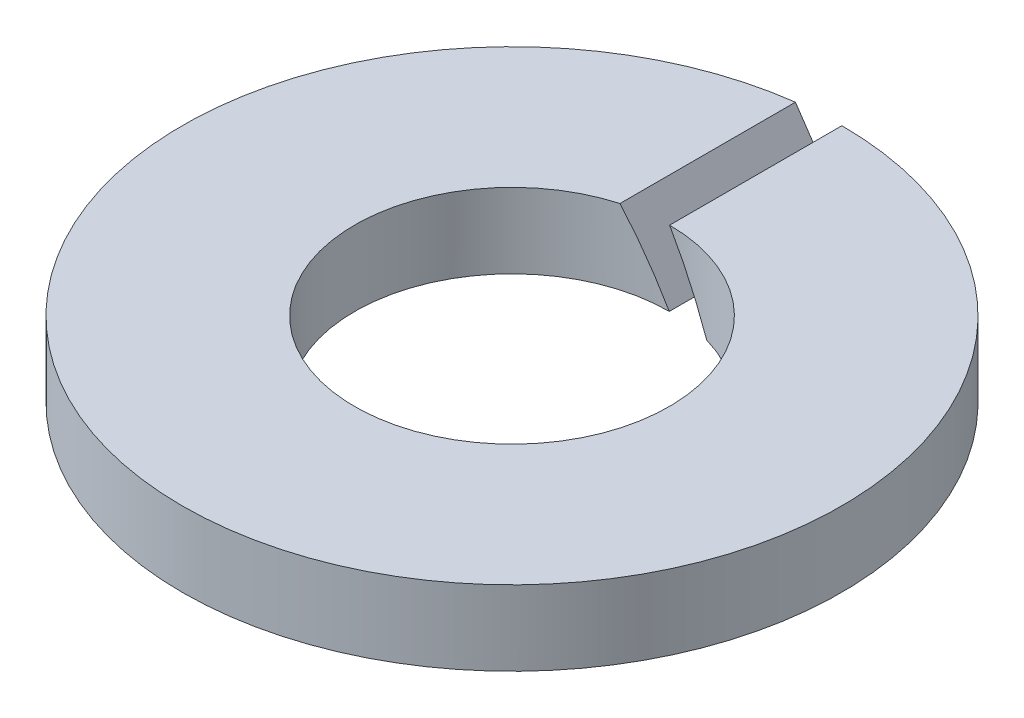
ISO-10303-21;
HEADER;
FILE_DESCRIPTION(('STEP AP214'),'2;1');
FILE_NAME('part.step','',(''),(''),'','','');
FILE_SCHEMA(('AUTOMOTIVE_DESIGN { 1 0 10303 214 1 1 1 1 }'));
ENDSEC;
DATA;
#1=APPLICATION_CONTEXT('core data for automotive mechanical design processes');
#2=APPLICATION_PROTOCOL_DEFINITION('international standard','automotive_design',2000,#1);
#3=PRODUCT_CONTEXT('',#1,'mechanical');
#4=PRODUCT('Part','Part','',(#3));
#5=PRODUCT_RELATED_PRODUCT_CATEGORY('part','',(#4));
#6=PRODUCT_DEFINITION_FORMATION('','',#4);
#7=PRODUCT_DEFINITION_CONTEXT('part definition',#1,'design');
#8=PRODUCT_DEFINITION('design','',#6,#7);
#9=PRODUCT_DEFINITION_SHAPE('','',#8);
#10=(LENGTH_UNIT() NAMED_UNIT(*) SI_UNIT(.MILLI.,.METRE.));
#11=(NAMED_UNIT(*) PLANE_ANGLE_UNIT() SI_UNIT($,.RADIAN.));
#12=(NAMED_UNIT(*) SI_UNIT($,.STERADIAN.) SOLID_ANGLE_UNIT());
#13=UNCERTAINTY_MEASURE_WITH_UNIT(LENGTH_MEASURE(1.E-05),#10,'distance_accuracy_value','');
#14=(GEOMETRIC_REPRESENTATION_CONTEXT(3) GLOBAL_UNCERTAINTY_ASSIGNED_CONTEXT((#13)) GLOBAL_UNIT_ASSIGNED_CONTEXT((#10,
#11,#12)) REPRESENTATION_CONTEXT('',''));
#15=CARTESIAN_POINT('',(0.,0.,0.));
#16=DIRECTION('',(0.,0.,1.));
#17=DIRECTION('',(1.,0.,0.));
#18=AXIS2_PLACEMENT_3D('',#15,#16,#17);
#19=CARTESIAN_POINT('',(0.,0.5,0.));
#20=DIRECTION('',(0.,1.,0.));
#21=DIRECTION('',(0.,0.,1.));
#22=AXIS2_PLACEMENT_3D('',#19,#20,#21);
#23=PLANE('',#22);
#24=DIRECTION('',(0.,0.,1.));
#25=VECTOR('',#24,1.);
#26=CARTESIAN_POINT('',(-0.288675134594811,0.5,-2.2));
#27=LINE('',#26,#25);
#28=CARTESIAN_POINT('',(-0.288675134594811,0.5,-2.18097837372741));
#29=VERTEX_POINT('',#28);
#30=CARTESIAN_POINT('',(-0.288675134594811,0.5,-1.00953784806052));
#31=VERTEX_POINT('',#30);
#32=EDGE_CURVE('E64',#29,#31,#27,.T.);
#33=ORIENTED_EDGE('',*,*,#32,.F.);
#34=CARTESIAN_POINT('',(0.,0.5,0.));
#35=DIRECTION('',(0.,1.,0.));
#36=DIRECTION('',(0.,0.,1.));
#37=AXIS2_PLACEMENT_3D('',#34,#35,#36);
#38=CIRCLE('',#37,2.2);
#39=CARTESIAN_POINT('',(0.00230940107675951,0.5,-2.2));
#40=VERTEX_POINT('',#39);
#41=EDGE_CURVE('E86',#29,#40,#38,.T.);
#42=ORIENTED_EDGE('',*,*,#41,.T.);
#43=DIRECTION('',(0.,0.,1.));
#44=VECTOR('',#43,1.);
#45=CARTESIAN_POINT('',(0.00230940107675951,0.5,-2.2));
#46=LINE('',#45,#44);
#47=CARTESIAN_POINT('',(0.00230940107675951,0.5,-1.04999746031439));
#48=VERTEX_POINT('',#47);
#49=EDGE_CURVE('E80',#40,#48,#46,.T.);
#50=ORIENTED_EDGE('',*,*,#49,.T.);
#51=CARTESIAN_POINT('',(0.,0.5,0.));
#52=DIRECTION('',(0.,1.,0.));
#53=DIRECTION('',(0.,0.,1.));
#54=AXIS2_PLACEMENT_3D('',#51,#52,#53);
#55=CIRCLE('',#54,1.05);
#56=EDGE_CURVE('E97',#31,#48,#55,.T.);
#57=ORIENTED_EDGE('',*,*,#56,.F.);
#58=EDGE_LOOP('',(#33,#42,#50,#57));
#59=FACE_BOUND('',#58,.T.);
#60=ADVANCED_FACE('F39',(#59),#23,.T.);
#61=CARTESIAN_POINT('',(0.,0.,0.));
#62=DIRECTION('',(0.,1.,0.));
#63=DIRECTION('',(0.,0.,1.));
#64=AXIS2_PLACEMENT_3D('',#61,#62,#63);
#65=PLANE('',#64);
#66=CARTESIAN_POINT('',(0.,0.,0.));
#67=DIRECTION('',(0.,1.,0.));
#68=DIRECTION('',(0.,0.,1.));
#69=AXIS2_PLACEMENT_3D('',#66,#67,#68);
#70=CIRCLE('',#69,2.2);
#71=CARTESIAN_POINT('',(0.,0.,-2.2));
#72=VERTEX_POINT('',#71);
#73=CARTESIAN_POINT('',(0.290984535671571,0.,-2.18067145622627));
#74=VERTEX_POINT('',#73);
#75=EDGE_CURVE('E95',#72,#74,#70,.T.);
#76=ORIENTED_EDGE('',*,*,#75,.F.);
#77=DIRECTION('',(0.,0.,1.));
#78=VECTOR('',#77,1.);
#79=CARTESIAN_POINT('',(0.,0.,-2.2));
#80=LINE('',#79,#78);
#81=CARTESIAN_POINT('',(0.,0.,-1.05));
#82=VERTEX_POINT('',#81);
#83=EDGE_CURVE('E94',#72,#82,#80,.T.);
#84=ORIENTED_EDGE('',*,*,#83,.T.);
#85=CARTESIAN_POINT('',(0.,0.,0.));
#86=DIRECTION('',(0.,1.,0.));
#87=DIRECTION('',(0.,0.,1.));
#88=AXIS2_PLACEMENT_3D('',#85,#86,#87);
#89=CIRCLE('',#88,1.05);
#90=CARTESIAN_POINT('',(0.290984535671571,0.,-1.008874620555));
#91=VERTEX_POINT('',#90);
#92=EDGE_CURVE('E99',#82,#91,#89,.T.);
#93=ORIENTED_EDGE('',*,*,#92,.T.);
#94=DIRECTION('',(0.,0.,1.));
#95=VECTOR('',#94,1.);
#96=CARTESIAN_POINT('',(0.290984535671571,0.,-2.2));
#97=LINE('',#96,#95);
#98=EDGE_CURVE('E53',#74,#91,#97,.T.);
#99=ORIENTED_EDGE('',*,*,#98,.F.);
#100=EDGE_LOOP('',(#76,#84,#93,#99));
#101=FACE_BOUND('',#100,.T.);
#102=ADVANCED_FACE('F109',(#101),#65,.F.);
#103=CARTESIAN_POINT('',(0.,0.5,0.));
#104=DIRECTION('',(0.,-1.,0.));
#105=DIRECTION('',(0.,0.,-1.));
#106=AXIS2_PLACEMENT_3D('',#103,#104,#105);
#107=CYLINDRICAL_SURFACE('',#106,2.2);
#108=ORIENTED_EDGE('',*,*,#75,.T.);
#109=CARTESIAN_POINT('',(0.,0.504000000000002,0.));
#110=DIRECTION('',(0.86602540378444,0.499999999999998,0.));
#111=DIRECTION('',(0.499999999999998,-0.86602540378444,0.));
#112=AXIS2_PLACEMENT_3D('',#109,#110,#111);
#113=ELLIPSE('',#112,4.40000000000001,2.2);
#114=EDGE_CURVE('E78',#74,#40,#113,.T.);
#115=ORIENTED_EDGE('',*,*,#114,.T.);
#116=ORIENTED_EDGE('',*,*,#41,.F.);
#117=CARTESIAN_POINT('',(0.,0.,0.));
#118=DIRECTION('',(-0.86602540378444,-0.499999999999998,0.));
#119=DIRECTION('',(0.499999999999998,-0.86602540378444,0.));
#120=AXIS2_PLACEMENT_3D('',#117,#118,#119);
#121=ELLIPSE('',#120,4.40000000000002,2.2);
#122=EDGE_CURVE('E91',#29,#72,#121,.T.);
#123=ORIENTED_EDGE('',*,*,#122,.T.);
#124=EDGE_LOOP('',(#108,#115,#116,#123));
#125=FACE_BOUND('',#124,.T.);
#126=ADVANCED_FACE('F41',(#125),#107,.T.);
#127=CARTESIAN_POINT('',(0.,0.5,0.));
#128=DIRECTION('',(0.,-1.,0.));
#129=DIRECTION('',(0.,0.,-1.));
#130=AXIS2_PLACEMENT_3D('',#127,#128,#129);
#131=CYLINDRICAL_SURFACE('',#130,1.05);
#132=CARTESIAN_POINT('',(0.,0.,0.));
#133=DIRECTION('',(-0.86602540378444,-0.499999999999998,0.));
#134=DIRECTION('',(0.499999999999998,-0.86602540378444,0.));
#135=AXIS2_PLACEMENT_3D('',#132,#133,#134);
#136=ELLIPSE('',#135,2.10000000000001,1.05);
#137=EDGE_CURVE('E11',#31,#82,#136,.T.);
#138=ORIENTED_EDGE('',*,*,#137,.F.);
#139=ORIENTED_EDGE('',*,*,#56,.T.);
#140=CARTESIAN_POINT('',(0.,0.504000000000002,0.));
#141=DIRECTION('',(0.86602540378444,0.499999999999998,0.));
#142=DIRECTION('',(0.499999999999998,-0.86602540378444,0.));
#143=AXIS2_PLACEMENT_3D('',#140,#141,#142);
#144=ELLIPSE('',#143,2.10000000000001,1.05);
#145=EDGE_CURVE('E50',#91,#48,#144,.T.);
#146=ORIENTED_EDGE('',*,*,#145,.F.);
#147=ORIENTED_EDGE('',*,*,#92,.F.);
#148=EDGE_LOOP('',(#138,#139,#146,#147));
#149=FACE_BOUND('',#148,.T.);
#150=ADVANCED_FACE('F115',(#149),#131,.F.);
#151=CARTESIAN_POINT('',(0.00230940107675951,0.5,-2.2));
#152=DIRECTION('',(0.86602540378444,0.499999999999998,0.));
#153=DIRECTION('',(-0.499999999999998,0.86602540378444,0.));
#154=AXIS2_PLACEMENT_3D('',#151,#152,#153);
#155=PLANE('',#154);
#156=ORIENTED_EDGE('',*,*,#98,.T.);
#157=ORIENTED_EDGE('',*,*,#145,.T.);
#158=ORIENTED_EDGE('',*,*,#49,.F.);
#159=ORIENTED_EDGE('',*,*,#114,.F.);
#160=EDGE_LOOP('',(#156,#157,#158,#159));
#161=FACE_BOUND('',#160,.T.);
#162=ADVANCED_FACE('F79',(#161),#155,.F.);
#163=CARTESIAN_POINT('',(0.,0.,-2.2));
#164=DIRECTION('',(-0.86602540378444,-0.499999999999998,0.));
#165=DIRECTION('',(0.499999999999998,-0.86602540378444,0.));
#166=AXIS2_PLACEMENT_3D('',#163,#164,#165);
#167=PLANE('',#166);
#168=ORIENTED_EDGE('',*,*,#32,.T.);
#169=ORIENTED_EDGE('',*,*,#137,.T.);
#170=ORIENTED_EDGE('',*,*,#83,.F.);
#171=ORIENTED_EDGE('',*,*,#122,.F.);
#172=EDGE_LOOP('',(#168,#169,#170,#171));
#173=FACE_BOUND('',#172,.T.);
#174=ADVANCED_FACE('F113',(#173),#167,.F.);
#175=CLOSED_SHELL('',(#60,#102,#126,#150,#162,#174));
#176=MANIFOLD_SOLID_BREP('B2',#175);
#177=ADVANCED_BREP_SHAPE_REPRESENTATION('',(#18,#176),#14);
#178=SHAPE_DEFINITION_REPRESENTATION(#9,#177);
ENDSEC;
END-ISO-10303-21;
